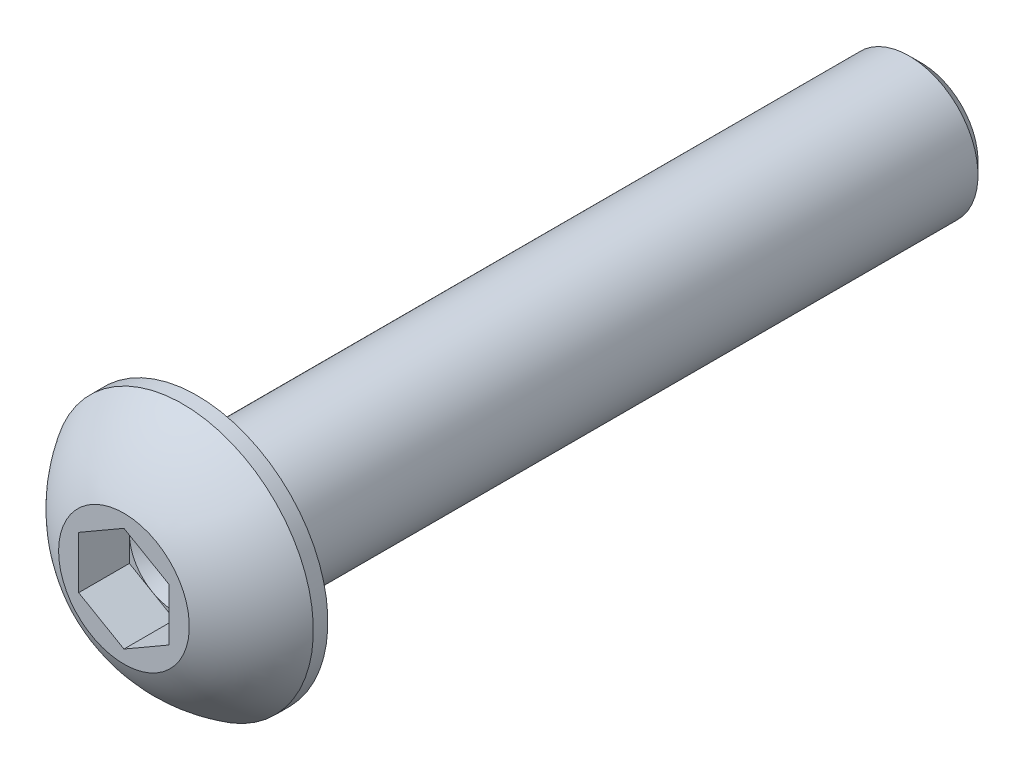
ISO-10303-21;
HEADER;
FILE_DESCRIPTION(('STEP AP214'),'2;1');
FILE_NAME('part.step','',(''),(''),'','','');
FILE_SCHEMA(('AUTOMOTIVE_DESIGN { 1 0 10303 214 1 1 1 1 }'));
ENDSEC;
DATA;
#1=APPLICATION_CONTEXT('core data for automotive mechanical design processes');
#2=APPLICATION_PROTOCOL_DEFINITION('international standard','automotive_design',2000,#1);
#3=PRODUCT_CONTEXT('',#1,'mechanical');
#4=PRODUCT('Part','Part','',(#3));
#5=PRODUCT_RELATED_PRODUCT_CATEGORY('part','',(#4));
#6=PRODUCT_DEFINITION_FORMATION('','',#4);
#7=PRODUCT_DEFINITION_CONTEXT('part definition',#1,'design');
#8=PRODUCT_DEFINITION('design','',#6,#7);
#9=PRODUCT_DEFINITION_SHAPE('','',#8);
#10=(LENGTH_UNIT() NAMED_UNIT(*) SI_UNIT(.MILLI.,.METRE.));
#11=(NAMED_UNIT(*) PLANE_ANGLE_UNIT() SI_UNIT($,.RADIAN.));
#12=(NAMED_UNIT(*) SI_UNIT($,.STERADIAN.) SOLID_ANGLE_UNIT());
#13=UNCERTAINTY_MEASURE_WITH_UNIT(LENGTH_MEASURE(1.E-05),#10,'distance_accuracy_value','');
#14=(GEOMETRIC_REPRESENTATION_CONTEXT(3) GLOBAL_UNCERTAINTY_ASSIGNED_CONTEXT((#13)) GLOBAL_UNIT_ASSIGNED_CONTEXT((#10,
#11,#12)) REPRESENTATION_CONTEXT('',''));
#15=CARTESIAN_POINT('',(0.,0.,0.));
#16=DIRECTION('',(0.,0.,1.));
#17=DIRECTION('',(1.,0.,0.));
#18=AXIS2_PLACEMENT_3D('',#15,#16,#17);
#19=CARTESIAN_POINT('',(0.,0.,-27.9654));
#20=DIRECTION('',(0.,0.,1.));
#21=DIRECTION('',(1.,0.,0.));
#22=AXIS2_PLACEMENT_3D('',#19,#20,#21);
#23=CONICAL_SURFACE('',#22,1.98405761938,0.785398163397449);
#24=CARTESIAN_POINT('',(0.,0.,-27.9654));
#25=DIRECTION('',(0.,0.,-1.));
#26=DIRECTION('',(-1.,0.,0.));
#27=AXIS2_PLACEMENT_3D('',#24,#25,#26);
#28=CIRCLE('',#27,1.98405761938);
#29=CARTESIAN_POINT('',(-1.98405761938,0.,-27.9654));
#30=VERTEX_POINT('',#29);
#31=EDGE_CURVE('E209',#30,#30,#28,.T.);
#32=ORIENTED_EDGE('',*,*,#31,.F.);
#33=EDGE_LOOP('',(#32));
#34=FACE_BOUND('',#33,.T.);
#35=CARTESIAN_POINT('',(0.,0.,-27.53645761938));
#36=DIRECTION('',(0.,0.,1.));
#37=DIRECTION('',(-1.,0.,0.));
#38=AXIS2_PLACEMENT_3D('',#35,#36,#37);
#39=CIRCLE('',#38,2.413);
#40=CARTESIAN_POINT('',(-2.413,0.,-27.53645761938));
#41=VERTEX_POINT('',#40);
#42=EDGE_CURVE('E212',#41,#41,#39,.T.);
#43=ORIENTED_EDGE('',*,*,#42,.F.);
#44=EDGE_LOOP('',(#43));
#45=FACE_BOUND('',#44,.T.);
#46=ADVANCED_FACE('F17',(#34,#45),#23,.T.);
#47=CARTESIAN_POINT('',(0.,0.,-1.778));
#48=DIRECTION('',(0.,0.,1.));
#49=DIRECTION('',(1.,0.,0.));
#50=AXIS2_PLACEMENT_3D('',#47,#48,#49);
#51=CONICAL_SURFACE('',#50,1.5875,1.0471975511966);
#52=CARTESIAN_POINT('',(0.,0.,-1.778));
#53=DIRECTION('',(0.,0.,1.));
#54=DIRECTION('',(1.,0.,0.));
#55=AXIS2_PLACEMENT_3D('',#52,#53,#54);
#56=CIRCLE('',#55,1.5875);
#57=CARTESIAN_POINT('',(1.5875,0.,-1.778));
#58=VERTEX_POINT('',#57);
#59=CARTESIAN_POINT('',(0.79375,1.3748153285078,-1.778));
#60=VERTEX_POINT('',#59);
#61=EDGE_CURVE('E163',#58,#60,#56,.T.);
#62=ORIENTED_EDGE('',*,*,#61,.T.);
#63=CARTESIAN_POINT('',(0.,0.,-1.778));
#64=DIRECTION('',(0.,0.,1.));
#65=DIRECTION('',(1.,0.,0.));
#66=AXIS2_PLACEMENT_3D('',#63,#64,#65);
#67=CIRCLE('',#66,1.5875);
#68=CARTESIAN_POINT('',(-0.79375,1.37481532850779,-1.778));
#69=VERTEX_POINT('',#68);
#70=EDGE_CURVE('E160',#60,#69,#67,.T.);
#71=ORIENTED_EDGE('',*,*,#70,.T.);
#72=CARTESIAN_POINT('',(0.,0.,-1.778));
#73=DIRECTION('',(0.,0.,1.));
#74=DIRECTION('',(1.,0.,0.));
#75=AXIS2_PLACEMENT_3D('',#72,#73,#74);
#76=CIRCLE('',#75,1.5875);
#77=CARTESIAN_POINT('',(-1.5875,0.,-1.778));
#78=VERTEX_POINT('',#77);
#79=EDGE_CURVE('E198',#69,#78,#76,.T.);
#80=ORIENTED_EDGE('',*,*,#79,.T.);
#81=CARTESIAN_POINT('',(0.,0.,-1.778));
#82=DIRECTION('',(0.,0.,1.));
#83=DIRECTION('',(1.,0.,0.));
#84=AXIS2_PLACEMENT_3D('',#81,#82,#83);
#85=CIRCLE('',#84,1.5875);
#86=CARTESIAN_POINT('',(-0.79375,-1.3748153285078,-1.778));
#87=VERTEX_POINT('',#86);
#88=EDGE_CURVE('E186',#78,#87,#85,.T.);
#89=ORIENTED_EDGE('',*,*,#88,.T.);
#90=CARTESIAN_POINT('',(0.,0.,-1.778));
#91=DIRECTION('',(0.,0.,1.));
#92=DIRECTION('',(1.,0.,0.));
#93=AXIS2_PLACEMENT_3D('',#90,#91,#92);
#94=CIRCLE('',#93,1.5875);
#95=CARTESIAN_POINT('',(0.79375,-1.37481532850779,-1.778));
#96=VERTEX_POINT('',#95);
#97=EDGE_CURVE('E177',#87,#96,#94,.T.);
#98=ORIENTED_EDGE('',*,*,#97,.T.);
#99=CARTESIAN_POINT('',(0.,0.,-1.778));
#100=DIRECTION('',(0.,0.,1.));
#101=DIRECTION('',(1.,0.,0.));
#102=AXIS2_PLACEMENT_3D('',#99,#100,#101);
#103=CIRCLE('',#102,1.5875);
#104=EDGE_CURVE('E11',#96,#58,#103,.T.);
#105=ORIENTED_EDGE('',*,*,#104,.T.);
#106=EDGE_LOOP('',(#62,#71,#80,#89,#98,#105));
#107=FACE_BOUND('',#106,.T.);
#108=CARTESIAN_POINT('',(0.,0.,-2.69454355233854));
#109=VERTEX_POINT('',#108);
#110=VERTEX_LOOP('',#109);
#111=FACE_BOUND('',#110,.T.);
#112=ADVANCED_FACE('F288',(#107,#111),#51,.F.);
#113=CARTESIAN_POINT('',(0.,0.,-1.778));
#114=DIRECTION('',(0.,0.,1.));
#115=DIRECTION('',(1.,0.,0.));
#116=AXIS2_PLACEMENT_3D('',#113,#114,#115);
#117=PLANE('',#116);
#118=ORIENTED_EDGE('',*,*,#104,.F.);
#119=DIRECTION('',(-0.866025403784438,-0.5,0.));
#120=VECTOR('',#119,1.);
#121=CARTESIAN_POINT('',(0.79375,-1.37481532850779,-1.778));
#122=LINE('',#121,#120);
#123=CARTESIAN_POINT('',(1.5875,-0.916543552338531,-1.778));
#124=VERTEX_POINT('',#123);
#125=EDGE_CURVE('E199',#124,#96,#122,.T.);
#126=ORIENTED_EDGE('',*,*,#125,.F.);
#127=DIRECTION('',(0.,-1.,0.));
#128=VECTOR('',#127,1.);
#129=CARTESIAN_POINT('',(1.5875,0.,-1.778));
#130=LINE('',#129,#128);
#131=EDGE_CURVE('E27',#58,#124,#130,.T.);
#132=ORIENTED_EDGE('',*,*,#131,.F.);
#133=EDGE_LOOP('',(#118,#126,#132));
#134=FACE_BOUND('',#133,.T.);
#135=ADVANCED_FACE('F292',(#134),#117,.T.);
#136=CARTESIAN_POINT('',(1.5875,0.,-1.778));
#137=DIRECTION('',(-1.,0.,0.));
#138=DIRECTION('',(0.,0.,1.));
#139=AXIS2_PLACEMENT_3D('',#136,#137,#138);
#140=PLANE('',#139);
#141=DIRECTION('',(0.,-1.,0.));
#142=VECTOR('',#141,1.);
#143=CARTESIAN_POINT('',(1.5875,0.,0.));
#144=LINE('',#143,#142);
#145=CARTESIAN_POINT('',(1.5875,0.916543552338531,0.));
#146=VERTEX_POINT('',#145);
#147=CARTESIAN_POINT('',(1.5875,-0.916543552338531,0.));
#148=VERTEX_POINT('',#147);
#149=EDGE_CURVE('E143',#146,#148,#144,.T.);
#150=ORIENTED_EDGE('',*,*,#149,.F.);
#151=DIRECTION('',(0.,0.,1.));
#152=VECTOR('',#151,1.);
#153=CARTESIAN_POINT('',(1.5875,0.916543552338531,-1.778));
#154=LINE('',#153,#152);
#155=CARTESIAN_POINT('',(1.5875,0.916543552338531,-1.778));
#156=VERTEX_POINT('',#155);
#157=EDGE_CURVE('E136',#156,#146,#154,.T.);
#158=ORIENTED_EDGE('',*,*,#157,.F.);
#159=DIRECTION('',(0.,-1.,0.));
#160=VECTOR('',#159,1.);
#161=CARTESIAN_POINT('',(1.5875,0.,-1.778));
#162=LINE('',#161,#160);
#163=EDGE_CURVE('E140',#156,#58,#162,.T.);
#164=ORIENTED_EDGE('',*,*,#163,.T.);
#165=ORIENTED_EDGE('',*,*,#131,.T.);
#166=DIRECTION('',(0.,0.,1.));
#167=VECTOR('',#166,1.);
#168=CARTESIAN_POINT('',(1.5875,-0.916543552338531,-1.778));
#169=LINE('',#168,#167);
#170=EDGE_CURVE('E20',#124,#148,#169,.T.);
#171=ORIENTED_EDGE('',*,*,#170,.T.);
#172=EDGE_LOOP('',(#150,#158,#164,#165,#171));
#173=FACE_BOUND('',#172,.T.);
#174=ADVANCED_FACE('F138',(#173),#140,.T.);
#175=CARTESIAN_POINT('',(0.79375,-1.37481532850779,-1.778));
#176=DIRECTION('',(-0.5,0.866025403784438,0.));
#177=DIRECTION('',(0.,0.,1.));
#178=AXIS2_PLACEMENT_3D('',#175,#176,#177);
#179=PLANE('',#178);
#180=DIRECTION('',(-0.866025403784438,-0.5,0.));
#181=VECTOR('',#180,1.);
#182=CARTESIAN_POINT('',(0.79375,-1.37481532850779,0.));
#183=LINE('',#182,#181);
#184=CARTESIAN_POINT('',(0.,-1.83308710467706,0.));
#185=VERTEX_POINT('',#184);
#186=EDGE_CURVE('E226',#148,#185,#183,.T.);
#187=ORIENTED_EDGE('',*,*,#186,.F.);
#188=ORIENTED_EDGE('',*,*,#170,.F.);
#189=ORIENTED_EDGE('',*,*,#125,.T.);
#190=DIRECTION('',(-0.866025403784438,-0.5,0.));
#191=VECTOR('',#190,1.);
#192=CARTESIAN_POINT('',(0.79375,-1.37481532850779,-1.778));
#193=LINE('',#192,#191);
#194=CARTESIAN_POINT('',(0.,-1.83308710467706,-1.778));
#195=VERTEX_POINT('',#194);
#196=EDGE_CURVE('E225',#96,#195,#193,.T.);
#197=ORIENTED_EDGE('',*,*,#196,.T.);
#198=DIRECTION('',(0.,0.,1.));
#199=VECTOR('',#198,1.);
#200=CARTESIAN_POINT('',(0.,-1.83308710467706,-1.778));
#201=LINE('',#200,#199);
#202=EDGE_CURVE('E265',#195,#185,#201,.T.);
#203=ORIENTED_EDGE('',*,*,#202,.T.);
#204=EDGE_LOOP('',(#187,#188,#189,#197,#203));
#205=FACE_BOUND('',#204,.T.);
#206=ADVANCED_FACE('F275',(#205),#179,.T.);
#207=CARTESIAN_POINT('',(-0.79375,-1.3748153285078,-1.778));
#208=DIRECTION('',(0.5,0.866025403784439,0.));
#209=DIRECTION('',(0.,0.,-1.));
#210=AXIS2_PLACEMENT_3D('',#207,#208,#209);
#211=PLANE('',#210);
#212=DIRECTION('',(-0.866025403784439,0.5,0.));
#213=VECTOR('',#212,1.);
#214=CARTESIAN_POINT('',(-0.79375,-1.3748153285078,0.));
#215=LINE('',#214,#213);
#216=CARTESIAN_POINT('',(-1.5875,-0.916543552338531,0.));
#217=VERTEX_POINT('',#216);
#218=EDGE_CURVE('E176',#185,#217,#215,.T.);
#219=ORIENTED_EDGE('',*,*,#218,.F.);
#220=ORIENTED_EDGE('',*,*,#202,.F.);
#221=DIRECTION('',(-0.866025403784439,0.5,0.));
#222=VECTOR('',#221,1.);
#223=CARTESIAN_POINT('',(-0.79375,-1.3748153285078,-1.778));
#224=LINE('',#223,#222);
#225=EDGE_CURVE('E181',#195,#87,#224,.T.);
#226=ORIENTED_EDGE('',*,*,#225,.T.);
#227=DIRECTION('',(-0.866025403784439,0.5,0.));
#228=VECTOR('',#227,1.);
#229=CARTESIAN_POINT('',(-0.79375,-1.3748153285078,-1.778));
#230=LINE('',#229,#228);
#231=CARTESIAN_POINT('',(-1.5875,-0.916543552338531,-1.778));
#232=VERTEX_POINT('',#231);
#233=EDGE_CURVE('E182',#87,#232,#230,.T.);
#234=ORIENTED_EDGE('',*,*,#233,.T.);
#235=DIRECTION('',(0.,0.,1.));
#236=VECTOR('',#235,1.);
#237=CARTESIAN_POINT('',(-1.5875,-0.916543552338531,-1.778));
#238=LINE('',#237,#236);
#239=EDGE_CURVE('E263',#232,#217,#238,.T.);
#240=ORIENTED_EDGE('',*,*,#239,.T.);
#241=EDGE_LOOP('',(#219,#220,#226,#234,#240));
#242=FACE_BOUND('',#241,.T.);
#243=ADVANCED_FACE('F299',(#242),#211,.T.);
#244=CARTESIAN_POINT('',(-1.5875,0.,-1.778));
#245=DIRECTION('',(1.,0.,0.));
#246=DIRECTION('',(0.,1.,0.));
#247=AXIS2_PLACEMENT_3D('',#244,#245,#246);
#248=PLANE('',#247);
#249=DIRECTION('',(0.,1.,0.));
#250=VECTOR('',#249,1.);
#251=CARTESIAN_POINT('',(-1.5875,0.,0.));
#252=LINE('',#251,#250);
#253=CARTESIAN_POINT('',(-1.5875,0.916543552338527,0.));
#254=VERTEX_POINT('',#253);
#255=EDGE_CURVE('E172',#217,#254,#252,.T.);
#256=ORIENTED_EDGE('',*,*,#255,.F.);
#257=ORIENTED_EDGE('',*,*,#239,.F.);
#258=DIRECTION('',(0.,1.,0.));
#259=VECTOR('',#258,1.);
#260=CARTESIAN_POINT('',(-1.5875,0.,-1.778));
#261=LINE('',#260,#259);
#262=EDGE_CURVE('E206',#232,#78,#261,.T.);
#263=ORIENTED_EDGE('',*,*,#262,.T.);
#264=DIRECTION('',(0.,1.,0.));
#265=VECTOR('',#264,1.);
#266=CARTESIAN_POINT('',(-1.5875,0.,-1.778));
#267=LINE('',#266,#265);
#268=CARTESIAN_POINT('',(-1.5875,0.916543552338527,-1.778));
#269=VERTEX_POINT('',#268);
#270=EDGE_CURVE('E183',#78,#269,#267,.T.);
#271=ORIENTED_EDGE('',*,*,#270,.T.);
#272=DIRECTION('',(0.,0.,1.));
#273=VECTOR('',#272,1.);
#274=CARTESIAN_POINT('',(-1.5875,0.916543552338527,-1.778));
#275=LINE('',#274,#273);
#276=EDGE_CURVE('E148',#269,#254,#275,.T.);
#277=ORIENTED_EDGE('',*,*,#276,.T.);
#278=EDGE_LOOP('',(#256,#257,#263,#271,#277));
#279=FACE_BOUND('',#278,.T.);
#280=ADVANCED_FACE('F305',(#279),#248,.T.);
#281=CARTESIAN_POINT('',(-0.79375,1.37481532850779,-1.778));
#282=DIRECTION('',(0.5,-0.866025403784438,0.));
#283=DIRECTION('',(0.,0.,-1.));
#284=AXIS2_PLACEMENT_3D('',#281,#282,#283);
#285=PLANE('',#284);
#286=DIRECTION('',(0.866025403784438,0.5,0.));
#287=VECTOR('',#286,1.);
#288=CARTESIAN_POINT('',(-0.79375,1.37481532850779,0.));
#289=LINE('',#288,#287);
#290=CARTESIAN_POINT('',(0.,1.83308710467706,0.));
#291=VERTEX_POINT('',#290);
#292=EDGE_CURVE('E240',#254,#291,#289,.T.);
#293=ORIENTED_EDGE('',*,*,#292,.F.);
#294=ORIENTED_EDGE('',*,*,#276,.F.);
#295=DIRECTION('',(0.866025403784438,0.5,0.));
#296=VECTOR('',#295,1.);
#297=CARTESIAN_POINT('',(-0.79375,1.37481532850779,-1.778));
#298=LINE('',#297,#296);
#299=EDGE_CURVE('E187',#269,#69,#298,.T.);
#300=ORIENTED_EDGE('',*,*,#299,.T.);
#301=DIRECTION('',(0.866025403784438,0.5,0.));
#302=VECTOR('',#301,1.);
#303=CARTESIAN_POINT('',(-0.79375,1.37481532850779,-1.778));
#304=LINE('',#303,#302);
#305=CARTESIAN_POINT('',(0.,1.83308710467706,-1.778));
#306=VERTEX_POINT('',#305);
#307=EDGE_CURVE('E194',#69,#306,#304,.T.);
#308=ORIENTED_EDGE('',*,*,#307,.T.);
#309=DIRECTION('',(0.,0.,1.));
#310=VECTOR('',#309,1.);
#311=CARTESIAN_POINT('',(0.,1.83308710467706,-1.778));
#312=LINE('',#311,#310);
#313=EDGE_CURVE('E149',#306,#291,#312,.T.);
#314=ORIENTED_EDGE('',*,*,#313,.T.);
#315=EDGE_LOOP('',(#293,#294,#300,#308,#314));
#316=FACE_BOUND('',#315,.T.);
#317=ADVANCED_FACE('F282',(#316),#285,.T.);
#318=CARTESIAN_POINT('',(0.79375,1.3748153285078,-1.778));
#319=DIRECTION('',(-0.5,-0.866025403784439,0.));
#320=DIRECTION('',(-0.866025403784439,0.5,0.));
#321=AXIS2_PLACEMENT_3D('',#318,#319,#320);
#322=PLANE('',#321);
#323=DIRECTION('',(0.866025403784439,-0.5,0.));
#324=VECTOR('',#323,1.);
#325=CARTESIAN_POINT('',(0.79375,1.3748153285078,0.));
#326=LINE('',#325,#324);
#327=EDGE_CURVE('E244',#291,#146,#326,.T.);
#328=ORIENTED_EDGE('',*,*,#327,.F.);
#329=ORIENTED_EDGE('',*,*,#313,.F.);
#330=DIRECTION('',(0.866025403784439,-0.5,0.));
#331=VECTOR('',#330,1.);
#332=CARTESIAN_POINT('',(0.79375,1.3748153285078,-1.778));
#333=LINE('',#332,#331);
#334=EDGE_CURVE('E155',#306,#60,#333,.T.);
#335=ORIENTED_EDGE('',*,*,#334,.T.);
#336=DIRECTION('',(0.866025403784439,-0.5,0.));
#337=VECTOR('',#336,1.);
#338=CARTESIAN_POINT('',(0.79375,1.3748153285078,-1.778));
#339=LINE('',#338,#337);
#340=EDGE_CURVE('E152',#60,#156,#339,.T.);
#341=ORIENTED_EDGE('',*,*,#340,.T.);
#342=ORIENTED_EDGE('',*,*,#157,.T.);
#343=EDGE_LOOP('',(#328,#329,#335,#341,#342));
#344=FACE_BOUND('',#343,.T.);
#345=ADVANCED_FACE('F153',(#344),#322,.T.);
#346=CARTESIAN_POINT('',(0.,0.,-4.85989606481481));
#347=DIRECTION('',(0.,0.,-1.));
#348=DIRECTION('',(-1.,0.,0.));
#349=AXIS2_PLACEMENT_3D('',#346,#347,#348);
#350=SPHERICAL_SURFACE('',#349,5.37340285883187);
#351=CARTESIAN_POINT('',(0.,0.,0.));
#352=DIRECTION('',(0.,0.,-1.));
#353=DIRECTION('',(-1.,0.,0.));
#354=AXIS2_PLACEMENT_3D('',#351,#352,#353);
#355=CIRCLE('',#354,2.29235);
#356=CARTESIAN_POINT('',(-2.29235,0.,0.));
#357=VERTEX_POINT('',#356);
#358=EDGE_CURVE('E233',#357,#357,#355,.T.);
#359=ORIENTED_EDGE('',*,*,#358,.T.);
#360=EDGE_LOOP('',(#359));
#361=FACE_BOUND('',#360,.T.);
#362=CARTESIAN_POINT('',(0.,0.,-2.0574));
#363=DIRECTION('',(0.,0.,-1.));
#364=DIRECTION('',(-1.,0.,0.));
#365=AXIS2_PLACEMENT_3D('',#362,#363,#364);
#366=CIRCLE('',#365,4.5847);
#367=CARTESIAN_POINT('',(-4.5847,0.,-2.0574));
#368=VERTEX_POINT('',#367);
#369=EDGE_CURVE('E175',#368,#368,#366,.T.);
#370=ORIENTED_EDGE('',*,*,#369,.F.);
#371=EDGE_LOOP('',(#370));
#372=FACE_BOUND('',#371,.T.);
#373=ADVANCED_FACE('F345',(#361,#372),#350,.T.);
#374=CARTESIAN_POINT('',(-1.2065,0.,-27.9654));
#375=DIRECTION('',(0.,0.,-1.));
#376=DIRECTION('',(0.,-1.,0.));
#377=AXIS2_PLACEMENT_3D('',#374,#375,#376);
#378=PLANE('',#377);
#379=ORIENTED_EDGE('',*,*,#31,.T.);
#380=EDGE_LOOP('',(#379));
#381=FACE_BOUND('',#380,.T.);
#382=ADVANCED_FACE('F335',(#381),#378,.T.);
#383=CARTESIAN_POINT('',(0.,0.,1.48381805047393));
#384=DIRECTION('',(0.,0.,-1.));
#385=DIRECTION('',(-1.,0.,0.));
#386=AXIS2_PLACEMENT_3D('',#383,#384,#385);
#387=CYLINDRICAL_SURFACE('',#386,2.413);
#388=CARTESIAN_POINT('',(0.,0.,-2.9464));
#389=DIRECTION('',(0.,0.,-1.));
#390=DIRECTION('',(-1.,0.,0.));
#391=AXIS2_PLACEMENT_3D('',#388,#389,#390);
#392=CIRCLE('',#391,2.413);
#393=CARTESIAN_POINT('',(-2.413,0.,-2.9464));
#394=VERTEX_POINT('',#393);
#395=EDGE_CURVE('E256',#394,#394,#392,.T.);
#396=ORIENTED_EDGE('',*,*,#395,.T.);
#397=EDGE_LOOP('',(#396));
#398=FACE_BOUND('',#397,.T.);
#399=ORIENTED_EDGE('',*,*,#42,.T.);
#400=EDGE_LOOP('',(#399));
#401=FACE_BOUND('',#400,.T.);
#402=ADVANCED_FACE('F332',(#398,#401),#387,.T.);
#403=CARTESIAN_POINT('',(0.,0.,-2.9464));
#404=DIRECTION('',(0.,0.,-1.));
#405=DIRECTION('',(-1.,0.,0.));
#406=AXIS2_PLACEMENT_3D('',#403,#404,#405);
#407=TOROIDAL_SURFACE('',#406,2.794,0.381);
#408=ORIENTED_EDGE('',*,*,#395,.F.);
#409=EDGE_LOOP('',(#408));
#410=FACE_BOUND('',#409,.T.);
#411=CARTESIAN_POINT('',(0.,0.,-2.5654));
#412=DIRECTION('',(0.,0.,-1.));
#413=DIRECTION('',(-1.,0.,0.));
#414=AXIS2_PLACEMENT_3D('',#411,#412,#413);
#415=CIRCLE('',#414,2.794);
#416=CARTESIAN_POINT('',(-2.794,0.,-2.5654));
#417=VERTEX_POINT('',#416);
#418=EDGE_CURVE('E237',#417,#417,#415,.T.);
#419=ORIENTED_EDGE('',*,*,#418,.T.);
#420=EDGE_LOOP('',(#419));
#421=FACE_BOUND('',#420,.T.);
#422=ADVANCED_FACE('F334',(#410,#421),#407,.F.);
#423=CARTESIAN_POINT('',(-3.68935,0.,-2.5654));
#424=DIRECTION('',(0.,0.,-1.));
#425=DIRECTION('',(0.,-1.,0.));
#426=AXIS2_PLACEMENT_3D('',#423,#424,#425);
#427=PLANE('',#426);
#428=ORIENTED_EDGE('',*,*,#418,.F.);
#429=EDGE_LOOP('',(#428));
#430=FACE_BOUND('',#429,.T.);
#431=CARTESIAN_POINT('',(0.,0.,-2.5654));
#432=DIRECTION('',(0.,0.,-1.));
#433=DIRECTION('',(-1.,0.,0.));
#434=AXIS2_PLACEMENT_3D('',#431,#432,#433);
#435=CIRCLE('',#434,4.5847);
#436=CARTESIAN_POINT('',(-4.5847,0.,-2.5654));
#437=VERTEX_POINT('',#436);
#438=EDGE_CURVE('E234',#437,#437,#435,.T.);
#439=ORIENTED_EDGE('',*,*,#438,.T.);
#440=EDGE_LOOP('',(#439));
#441=FACE_BOUND('',#440,.T.);
#442=ADVANCED_FACE('F342',(#430,#441),#427,.T.);
#443=CARTESIAN_POINT('',(0.,0.,1.48381805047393));
#444=DIRECTION('',(0.,0.,-1.));
#445=DIRECTION('',(-1.,0.,0.));
#446=AXIS2_PLACEMENT_3D('',#443,#444,#445);
#447=CYLINDRICAL_SURFACE('',#446,4.5847);
#448=ORIENTED_EDGE('',*,*,#438,.F.);
#449=EDGE_LOOP('',(#448));
#450=FACE_BOUND('',#449,.T.);
#451=ORIENTED_EDGE('',*,*,#369,.T.);
#452=EDGE_LOOP('',(#451));
#453=FACE_BOUND('',#452,.T.);
#454=ADVANCED_FACE('F352',(#450,#453),#447,.T.);
#455=CARTESIAN_POINT('',(-1.146175,0.,0.));
#456=DIRECTION('',(0.,0.,1.));
#457=DIRECTION('',(1.,0.,0.));
#458=AXIS2_PLACEMENT_3D('',#455,#456,#457);
#459=PLANE('',#458);
#460=ORIENTED_EDGE('',*,*,#292,.T.);
#461=ORIENTED_EDGE('',*,*,#327,.T.);
#462=ORIENTED_EDGE('',*,*,#149,.T.);
#463=ORIENTED_EDGE('',*,*,#186,.T.);
#464=ORIENTED_EDGE('',*,*,#218,.T.);
#465=ORIENTED_EDGE('',*,*,#255,.T.);
#466=EDGE_LOOP('',(#460,#461,#462,#463,#464,#465));
#467=FACE_BOUND('',#466,.T.);
#468=ORIENTED_EDGE('',*,*,#358,.F.);
#469=EDGE_LOOP('',(#468));
#470=FACE_BOUND('',#469,.T.);
#471=ADVANCED_FACE('F277',(#467,#470),#459,.T.);
#472=CARTESIAN_POINT('',(0.,0.,-1.778));
#473=DIRECTION('',(0.,0.,1.));
#474=DIRECTION('',(1.,0.,0.));
#475=AXIS2_PLACEMENT_3D('',#472,#473,#474);
#476=PLANE('',#475);
#477=ORIENTED_EDGE('',*,*,#97,.F.);
#478=ORIENTED_EDGE('',*,*,#225,.F.);
#479=ORIENTED_EDGE('',*,*,#196,.F.);
#480=EDGE_LOOP('',(#477,#478,#479));
#481=FACE_BOUND('',#480,.T.);
#482=ADVANCED_FACE('F296',(#481),#476,.T.);
#483=CARTESIAN_POINT('',(0.,0.,-1.778));
#484=DIRECTION('',(0.,0.,1.));
#485=DIRECTION('',(1.,0.,0.));
#486=AXIS2_PLACEMENT_3D('',#483,#484,#485);
#487=PLANE('',#486);
#488=ORIENTED_EDGE('',*,*,#88,.F.);
#489=ORIENTED_EDGE('',*,*,#262,.F.);
#490=ORIENTED_EDGE('',*,*,#233,.F.);
#491=EDGE_LOOP('',(#488,#489,#490));
#492=FACE_BOUND('',#491,.T.);
#493=ADVANCED_FACE('F310',(#492),#487,.T.);
#494=CARTESIAN_POINT('',(0.,0.,-1.778));
#495=DIRECTION('',(0.,0.,1.));
#496=DIRECTION('',(1.,0.,0.));
#497=AXIS2_PLACEMENT_3D('',#494,#495,#496);
#498=PLANE('',#497);
#499=ORIENTED_EDGE('',*,*,#79,.F.);
#500=ORIENTED_EDGE('',*,*,#299,.F.);
#501=ORIENTED_EDGE('',*,*,#270,.F.);
#502=EDGE_LOOP('',(#499,#500,#501));
#503=FACE_BOUND('',#502,.T.);
#504=ADVANCED_FACE('F308',(#503),#498,.T.);
#505=CARTESIAN_POINT('',(0.,0.,-1.778));
#506=DIRECTION('',(0.,0.,1.));
#507=DIRECTION('',(1.,0.,0.));
#508=AXIS2_PLACEMENT_3D('',#505,#506,#507);
#509=PLANE('',#508);
#510=ORIENTED_EDGE('',*,*,#70,.F.);
#511=ORIENTED_EDGE('',*,*,#334,.F.);
#512=ORIENTED_EDGE('',*,*,#307,.F.);
#513=EDGE_LOOP('',(#510,#511,#512));
#514=FACE_BOUND('',#513,.T.);
#515=ADVANCED_FACE('F286',(#514),#509,.T.);
#516=CARTESIAN_POINT('',(0.,0.,-1.778));
#517=DIRECTION('',(0.,0.,1.));
#518=DIRECTION('',(1.,0.,0.));
#519=AXIS2_PLACEMENT_3D('',#516,#517,#518);
#520=PLANE('',#519);
#521=ORIENTED_EDGE('',*,*,#61,.F.);
#522=ORIENTED_EDGE('',*,*,#163,.F.);
#523=ORIENTED_EDGE('',*,*,#340,.F.);
#524=EDGE_LOOP('',(#521,#522,#523));
#525=FACE_BOUND('',#524,.T.);
#526=ADVANCED_FACE('F162',(#525),#520,.T.);
#527=CLOSED_SHELL('',(#46,#112,#135,#174,#206,#243,#280,#317,#345,#373,#382,#402,#422,#442,#454,
#471,#482,#493,#504,#515,#526));
#528=MANIFOLD_SOLID_BREP('B1',#527);
#529=ADVANCED_BREP_SHAPE_REPRESENTATION('',(#18,#528),#14);
#530=SHAPE_DEFINITION_REPRESENTATION(#9,#529);
ENDSEC;
END-ISO-10303-21;
